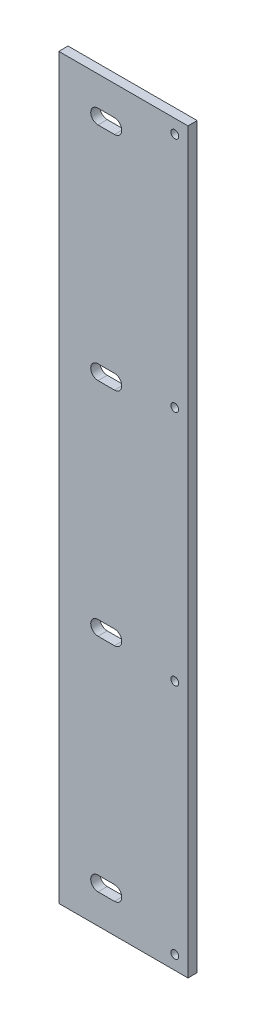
from build123d import *

# Parameters (mm, degrees)
SKETCH1_W             = 44.45
SKETCH1_H             = 254
BOSS_EXTRUDE1_DEPTH   = 3.175
F_6_32_TAPPED_HOLE1_D = 2.7051
SKETCH5_OUTSIDE_W     = 98.026
SKETCH5_OUTSIDE_H     = 307.576
SKETCH5_OUTSIDE_W_2   = 44.45
SKETCH5_OUTSIDE_H_2   = 254
CUT_EXTRUDE1_DEPTH    = 186.902081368


with BuildPart() as part:
    # Sketch1 → Boss-Extrude1 (new body)
    with BuildSketch(Plane.XY):
        with Locations((7.235695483, 56.525395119)):
            Rectangle(SKETCH1_W, SKETCH1_H)
    extrude(amount=BOSS_EXTRUDE1_DEPTH)

    # 6-32 Tapped Hole1 (through all)
    with Locations(Plane.XY.offset(3.175)):
        with Locations((24.924255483, 178.775595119), (24.924255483, 97.292395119), (24.924255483, 15.758395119), (24.924255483, -65.724804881)):
            Hole(F_6_32_TAPPED_HOLE1_D / 2)

    # Sketch5 outside → Cut-Extrude1 (cut, through all)
    # profile 1 of 5: a face of its own
    with BuildSketch(Plane.XY.offset(3.175)):
        with Locations((7.236, 56.525)):
            Rectangle(SKETCH5_OUTSIDE_W, SKETCH5_OUTSIDE_H)
        with Locations((7.235695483, 56.525395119)):
            Rectangle(SKETCH5_OUTSIDE_W_2, SKETCH5_OUTSIDE_H_2, mode=Mode.SUBTRACT)
    # profile 2 of 5: a face of its own
    with BuildSketch(Plane.XY.offset(3.175)):
        with BuildLine():
            Line((-1.507829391, 173.325395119), (4.172170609, 173.325395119))
            ThreePointArc((4.172170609, 173.325395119), (6.672170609, 170.825395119), (4.172170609, 168.325395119))
            Line((4.172170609, 168.325395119), (-1.507829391, 168.325395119))
            ThreePointArc((-1.507829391, 168.325395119), (-4.007829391, 170.825395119), (-1.507829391, 173.325395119))
        make_face()
    # profile 3 of 5: a face of its own
    with BuildSketch(Plane.XY.offset(3.175)):
        with BuildLine():
            Line((-1.507829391, 97.125395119), (4.172170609, 97.125395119))
            ThreePointArc((4.172170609, 97.125395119), (6.672170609, 94.625395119), (4.172170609, 92.125395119))
            Line((4.172170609, 92.125395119), (-1.507829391, 92.125395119))
            ThreePointArc((-1.507829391, 92.125395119), (-4.007829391, 94.625395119), (-1.507829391, 97.125395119))
        make_face()
    # profile 4 of 5: a face of its own
    with BuildSketch(Plane.XY.offset(3.175)):
        with BuildLine():
            Line((-1.507829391, 20.925395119), (4.172170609, 20.925395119))
            ThreePointArc((4.172170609, 20.925395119), (6.672170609, 18.425395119), (4.172170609, 15.925395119))
            Line((4.172170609, 15.925395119), (-1.507829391, 15.925395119))
            ThreePointArc((-1.507829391, 15.925395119), (-4.007829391, 18.425395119), (-1.507829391, 20.925395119))
        make_face()
    # profile 5 of 5: a face of its own
    with BuildSketch(Plane.XY.offset(3.175)):
        with BuildLine():
            Line((-1.507829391, -55.274604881), (4.172170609, -55.274604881))
            ThreePointArc((4.172170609, -55.274604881), (6.672170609, -57.774604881), (4.172170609, -60.274604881))
            Line((4.172170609, -60.274604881), (-1.507829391, -60.274604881))
            ThreePointArc((-1.507829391, -60.274604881), (-4.007829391, -57.774604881), (-1.507829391, -55.274604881))
        make_face()
    extrude(amount=-CUT_EXTRUDE1_DEPTH, mode=Mode.SUBTRACT)


solid = part.part
